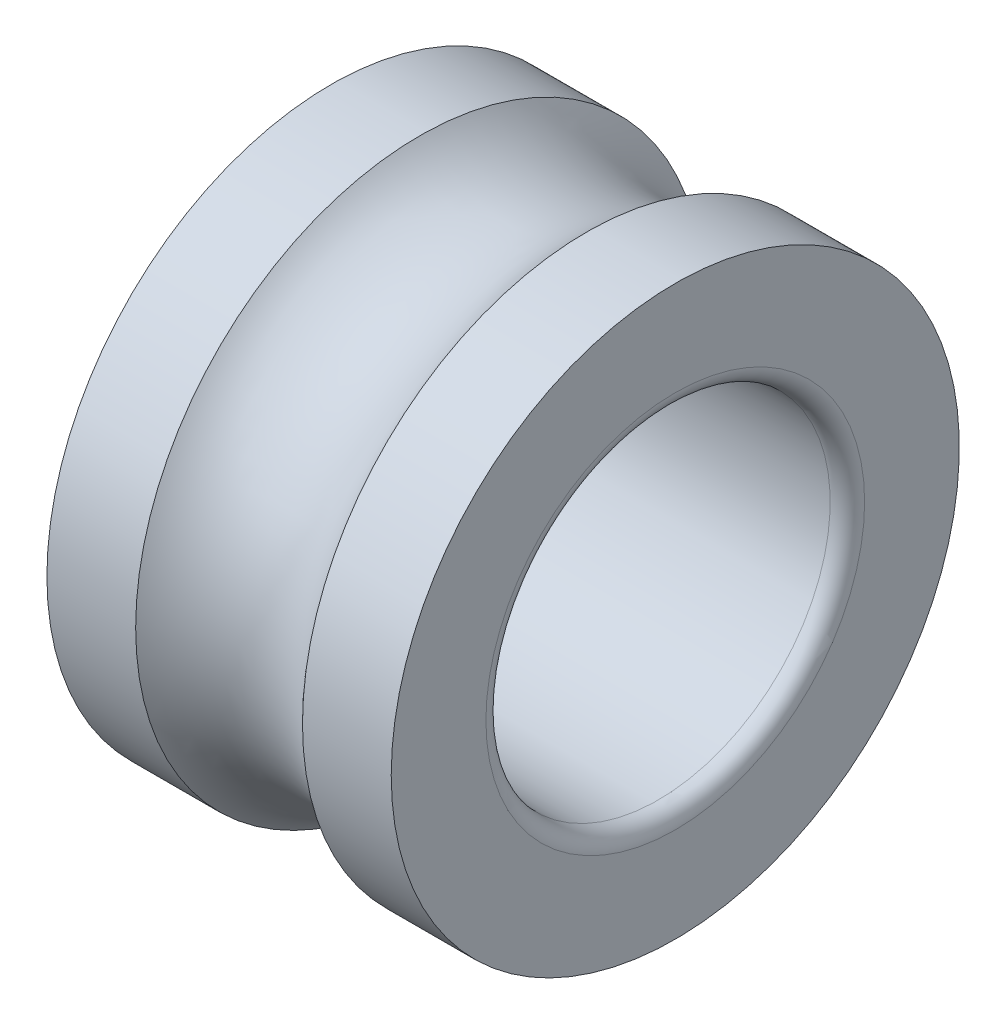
ISO-10303-21;
HEADER;
FILE_DESCRIPTION(('STEP AP214'),'2;1');
FILE_NAME('part.step','',(''),(''),'','','');
FILE_SCHEMA(('AUTOMOTIVE_DESIGN { 1 0 10303 214 1 1 1 1 }'));
ENDSEC;
DATA;
#1=APPLICATION_CONTEXT('core data for automotive mechanical design processes');
#2=APPLICATION_PROTOCOL_DEFINITION('international standard','automotive_design',2000,#1);
#3=PRODUCT_CONTEXT('',#1,'mechanical');
#4=PRODUCT('Part','Part','',(#3));
#5=PRODUCT_RELATED_PRODUCT_CATEGORY('part','',(#4));
#6=PRODUCT_DEFINITION_FORMATION('','',#4);
#7=PRODUCT_DEFINITION_CONTEXT('part definition',#1,'design');
#8=PRODUCT_DEFINITION('design','',#6,#7);
#9=PRODUCT_DEFINITION_SHAPE('','',#8);
#10=(LENGTH_UNIT() NAMED_UNIT(*) SI_UNIT(.MILLI.,.METRE.));
#11=(NAMED_UNIT(*) PLANE_ANGLE_UNIT() SI_UNIT($,.RADIAN.));
#12=(NAMED_UNIT(*) SI_UNIT($,.STERADIAN.) SOLID_ANGLE_UNIT());
#13=UNCERTAINTY_MEASURE_WITH_UNIT(LENGTH_MEASURE(1.E-05),#10,'distance_accuracy_value','');
#14=(GEOMETRIC_REPRESENTATION_CONTEXT(3) GLOBAL_UNCERTAINTY_ASSIGNED_CONTEXT((#13)) GLOBAL_UNIT_ASSIGNED_CONTEXT((#10,
#11,#12)) REPRESENTATION_CONTEXT('',''));
#15=CARTESIAN_POINT('',(0.,0.,0.));
#16=DIRECTION('',(0.,0.,1.));
#17=DIRECTION('',(1.,0.,0.));
#18=AXIS2_PLACEMENT_3D('',#15,#16,#17);
#19=CARTESIAN_POINT('',(0.300000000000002,0.,0.));
#20=DIRECTION('',(-1.,0.,0.));
#21=DIRECTION('',(0.,0.,1.));
#22=AXIS2_PLACEMENT_3D('',#19,#20,#21);
#23=TOROIDAL_SURFACE('',#22,3.3,0.300000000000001);
#24=CARTESIAN_POINT('',(0.300000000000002,0.,0.));
#25=DIRECTION('',(-1.,0.,0.));
#26=DIRECTION('',(0.,0.,1.));
#27=AXIS2_PLACEMENT_3D('',#24,#25,#26);
#28=CIRCLE('',#27,3.);
#29=CARTESIAN_POINT('',(0.300000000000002,0.,3.));
#30=VERTEX_POINT('',#29);
#31=EDGE_CURVE('E10',#30,#30,#28,.T.);
#32=ORIENTED_EDGE('',*,*,#31,.F.);
#33=EDGE_LOOP('',(#32));
#34=FACE_BOUND('',#33,.T.);
#35=CARTESIAN_POINT('',(0.,0.,0.));
#36=DIRECTION('',(-1.,0.,0.));
#37=DIRECTION('',(0.,0.,1.));
#38=AXIS2_PLACEMENT_3D('',#35,#36,#37);
#39=CIRCLE('',#38,3.3);
#40=CARTESIAN_POINT('',(0.,0.,3.3));
#41=VERTEX_POINT('',#40);
#42=EDGE_CURVE('E57',#41,#41,#39,.T.);
#43=ORIENTED_EDGE('',*,*,#42,.T.);
#44=EDGE_LOOP('',(#43));
#45=FACE_BOUND('',#44,.T.);
#46=ADVANCED_FACE('F29',(#34,#45),#23,.T.);
#47=CARTESIAN_POINT('',(0.,0.,0.));
#48=DIRECTION('',(-1.,0.,0.));
#49=DIRECTION('',(0.,0.,1.));
#50=AXIS2_PLACEMENT_3D('',#47,#48,#49);
#51=CYLINDRICAL_SURFACE('',#50,3.);
#52=CARTESIAN_POINT('',(5.70000000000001,0.,0.));
#53=DIRECTION('',(-1.,0.,0.));
#54=DIRECTION('',(0.,0.,1.));
#55=AXIS2_PLACEMENT_3D('',#52,#53,#54);
#56=CIRCLE('',#55,3.);
#57=CARTESIAN_POINT('',(5.70000000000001,0.,3.));
#58=VERTEX_POINT('',#57);
#59=EDGE_CURVE('E35',#58,#58,#56,.T.);
#60=ORIENTED_EDGE('',*,*,#59,.F.);
#61=EDGE_LOOP('',(#60));
#62=FACE_BOUND('',#61,.T.);
#63=ORIENTED_EDGE('',*,*,#31,.T.);
#64=EDGE_LOOP('',(#63));
#65=FACE_BOUND('',#64,.T.);
#66=ADVANCED_FACE('F94',(#62,#65),#51,.F.);
#67=CARTESIAN_POINT('',(5.7,0.,0.));
#68=DIRECTION('',(-1.,0.,0.));
#69=DIRECTION('',(0.,0.,1.));
#70=AXIS2_PLACEMENT_3D('',#67,#68,#69);
#71=TOROIDAL_SURFACE('',#70,3.3,0.300000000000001);
#72=CARTESIAN_POINT('',(6.00000000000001,0.,0.));
#73=DIRECTION('',(-1.,0.,0.));
#74=DIRECTION('',(0.,0.,1.));
#75=AXIS2_PLACEMENT_3D('',#72,#73,#74);
#76=CIRCLE('',#75,3.3);
#77=CARTESIAN_POINT('',(6.00000000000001,0.,3.3));
#78=VERTEX_POINT('',#77);
#79=EDGE_CURVE('E39',#78,#78,#76,.T.);
#80=ORIENTED_EDGE('',*,*,#79,.F.);
#81=EDGE_LOOP('',(#80));
#82=FACE_BOUND('',#81,.T.);
#83=ORIENTED_EDGE('',*,*,#59,.T.);
#84=EDGE_LOOP('',(#83));
#85=FACE_BOUND('',#84,.T.);
#86=ADVANCED_FACE('F89',(#82,#85),#71,.T.);
#87=CARTESIAN_POINT('',(6.,0.,-4.95));
#88=DIRECTION('',(-1.,0.,0.));
#89=DIRECTION('',(0.,0.,1.));
#90=AXIS2_PLACEMENT_3D('',#87,#88,#89);
#91=PLANE('',#90);
#92=CARTESIAN_POINT('',(6.,0.,0.));
#93=DIRECTION('',(-1.,0.,0.));
#94=DIRECTION('',(0.,0.,1.));
#95=AXIS2_PLACEMENT_3D('',#92,#93,#94);
#96=CIRCLE('',#95,4.95);
#97=CARTESIAN_POINT('',(6.,0.,4.95));
#98=VERTEX_POINT('',#97);
#99=EDGE_CURVE('E43',#98,#98,#96,.T.);
#100=ORIENTED_EDGE('',*,*,#99,.F.);
#101=EDGE_LOOP('',(#100));
#102=FACE_BOUND('',#101,.T.);
#103=ORIENTED_EDGE('',*,*,#79,.T.);
#104=EDGE_LOOP('',(#103));
#105=FACE_BOUND('',#104,.T.);
#106=ADVANCED_FACE('F83',(#102,#105),#91,.F.);
#107=CARTESIAN_POINT('',(0.,0.,0.));
#108=DIRECTION('',(-1.,0.,0.));
#109=DIRECTION('',(0.,0.,1.));
#110=AXIS2_PLACEMENT_3D('',#107,#108,#109);
#111=CYLINDRICAL_SURFACE('',#110,4.95);
#112=CARTESIAN_POINT('',(4.45344418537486,0.,0.));
#113=DIRECTION('',(-1.,0.,0.));
#114=DIRECTION('',(0.,0.,1.));
#115=AXIS2_PLACEMENT_3D('',#112,#113,#114);
#116=CIRCLE('',#115,4.95);
#117=CARTESIAN_POINT('',(4.45344418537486,0.,4.95));
#118=VERTEX_POINT('',#117);
#119=EDGE_CURVE('E48',#118,#118,#116,.T.);
#120=ORIENTED_EDGE('',*,*,#119,.F.);
#121=EDGE_LOOP('',(#120));
#122=FACE_BOUND('',#121,.T.);
#123=ORIENTED_EDGE('',*,*,#99,.T.);
#124=EDGE_LOOP('',(#123));
#125=FACE_BOUND('',#124,.T.);
#126=ADVANCED_FACE('F77',(#122,#125),#111,.T.);
#127=CARTESIAN_POINT('',(3.,0.,0.));
#128=DIRECTION('',(-1.,0.,0.));
#129=DIRECTION('',(0.,0.,1.));
#130=AXIS2_PLACEMENT_3D('',#127,#128,#129);
#131=TOROIDAL_SURFACE('',#130,6.25,1.95);
#132=CARTESIAN_POINT('',(1.54655581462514,0.,0.));
#133=DIRECTION('',(-1.,0.,0.));
#134=DIRECTION('',(0.,0.,1.));
#135=AXIS2_PLACEMENT_3D('',#132,#133,#134);
#136=CIRCLE('',#135,4.95);
#137=CARTESIAN_POINT('',(1.54655581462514,0.,4.95));
#138=VERTEX_POINT('',#137);
#139=EDGE_CURVE('E51',#138,#138,#136,.T.);
#140=ORIENTED_EDGE('',*,*,#139,.F.);
#141=EDGE_LOOP('',(#140));
#142=FACE_BOUND('',#141,.T.);
#143=ORIENTED_EDGE('',*,*,#119,.T.);
#144=EDGE_LOOP('',(#143));
#145=FACE_BOUND('',#144,.T.);
#146=ADVANCED_FACE('F71',(#142,#145),#131,.F.);
#147=CARTESIAN_POINT('',(0.,0.,0.));
#148=DIRECTION('',(-1.,0.,0.));
#149=DIRECTION('',(0.,0.,1.));
#150=AXIS2_PLACEMENT_3D('',#147,#148,#149);
#151=CYLINDRICAL_SURFACE('',#150,4.95);
#152=CARTESIAN_POINT('',(0.,0.,0.));
#153=DIRECTION('',(-1.,0.,0.));
#154=DIRECTION('',(0.,0.,1.));
#155=AXIS2_PLACEMENT_3D('',#152,#153,#154);
#156=CIRCLE('',#155,4.95);
#157=CARTESIAN_POINT('',(0.,0.,4.95));
#158=VERTEX_POINT('',#157);
#159=EDGE_CURVE('E54',#158,#158,#156,.T.);
#160=ORIENTED_EDGE('',*,*,#159,.F.);
#161=EDGE_LOOP('',(#160));
#162=FACE_BOUND('',#161,.T.);
#163=ORIENTED_EDGE('',*,*,#139,.T.);
#164=EDGE_LOOP('',(#163));
#165=FACE_BOUND('',#164,.T.);
#166=ADVANCED_FACE('F65',(#162,#165),#151,.T.);
#167=CARTESIAN_POINT('',(0.,0.,-4.95));
#168=DIRECTION('',(1.,0.,0.));
#169=DIRECTION('',(0.,0.,-1.));
#170=AXIS2_PLACEMENT_3D('',#167,#168,#169);
#171=PLANE('',#170);
#172=ORIENTED_EDGE('',*,*,#42,.F.);
#173=EDGE_LOOP('',(#172));
#174=FACE_BOUND('',#173,.T.);
#175=ORIENTED_EDGE('',*,*,#159,.T.);
#176=EDGE_LOOP('',(#175));
#177=FACE_BOUND('',#176,.T.);
#178=ADVANCED_FACE('F62',(#174,#177),#171,.F.);
#179=CLOSED_SHELL('',(#46,#66,#86,#106,#126,#146,#166,#178));
#180=MANIFOLD_SOLID_BREP('B2',#179);
#181=ADVANCED_BREP_SHAPE_REPRESENTATION('',(#18,#180),#14);
#182=SHAPE_DEFINITION_REPRESENTATION(#9,#181);
ENDSEC;
END-ISO-10303-21;
